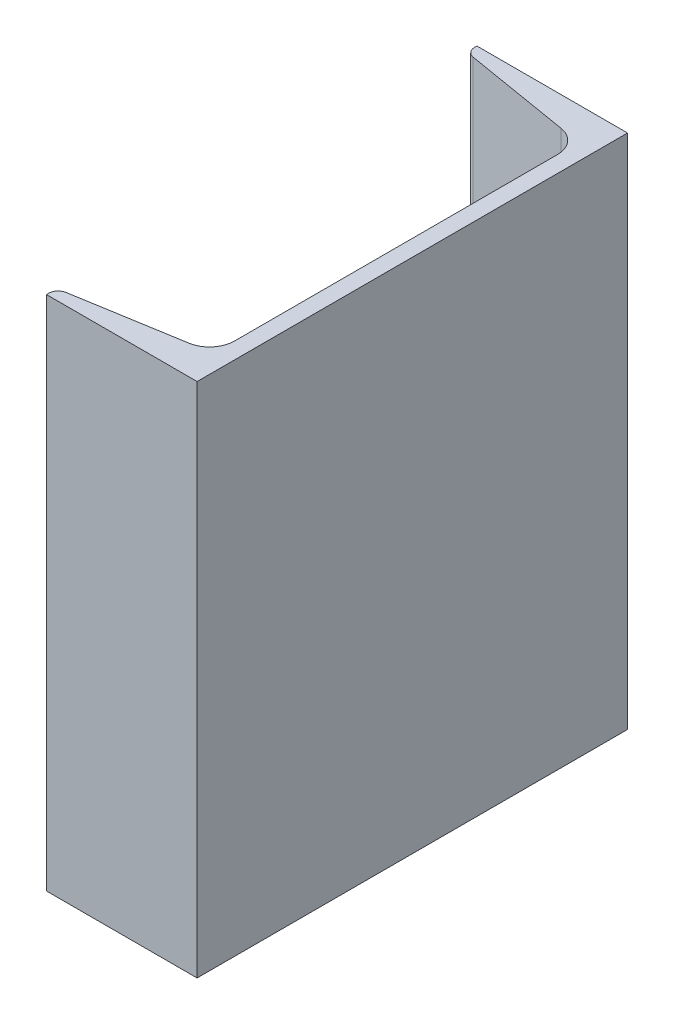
ISO-10303-21;
HEADER;
FILE_DESCRIPTION(('STEP AP214'),'2;1');
FILE_NAME('part.step','',(''),(''),'','','');
FILE_SCHEMA(('AUTOMOTIVE_DESIGN { 1 0 10303 214 1 1 1 1 }'));
ENDSEC;
DATA;
#1=APPLICATION_CONTEXT('core data for automotive mechanical design processes');
#2=APPLICATION_PROTOCOL_DEFINITION('international standard','automotive_design',2000,#1);
#3=PRODUCT_CONTEXT('',#1,'mechanical');
#4=PRODUCT('Part','Part','',(#3));
#5=PRODUCT_RELATED_PRODUCT_CATEGORY('part','',(#4));
#6=PRODUCT_DEFINITION_FORMATION('','',#4);
#7=PRODUCT_DEFINITION_CONTEXT('part definition',#1,'design');
#8=PRODUCT_DEFINITION('design','',#6,#7);
#9=PRODUCT_DEFINITION_SHAPE('','',#8);
#10=(LENGTH_UNIT() NAMED_UNIT(*) SI_UNIT(.MILLI.,.METRE.));
#11=(NAMED_UNIT(*) PLANE_ANGLE_UNIT() SI_UNIT($,.RADIAN.));
#12=(NAMED_UNIT(*) SI_UNIT($,.STERADIAN.) SOLID_ANGLE_UNIT());
#13=UNCERTAINTY_MEASURE_WITH_UNIT(LENGTH_MEASURE(1.E-05),#10,'distance_accuracy_value','');
#14=(GEOMETRIC_REPRESENTATION_CONTEXT(3) GLOBAL_UNCERTAINTY_ASSIGNED_CONTEXT((#13)) GLOBAL_UNIT_ASSIGNED_CONTEXT((#10,
#11,#12)) REPRESENTATION_CONTEXT('',''));
#15=CARTESIAN_POINT('',(0.,0.,0.));
#16=DIRECTION('',(0.,0.,1.));
#17=DIRECTION('',(1.,0.,0.));
#18=AXIS2_PLACEMENT_3D('',#15,#16,#17);
#19=CARTESIAN_POINT('',(0.,152.4,0.));
#20=DIRECTION('',(0.,0.,1.));
#21=DIRECTION('',(1.,0.,0.));
#22=AXIS2_PLACEMENT_3D('',#19,#20,#21);
#23=PLANE('',#22);
#24=DIRECTION('',(-1.,0.,0.));
#25=VECTOR('',#24,1.);
#26=CARTESIAN_POINT('',(0.,0.,0.));
#27=LINE('',#26,#25);
#28=CARTESIAN_POINT('',(0.,0.,0.));
#29=VERTEX_POINT('',#28);
#30=CARTESIAN_POINT('',(-44.45,0.,0.));
#31=VERTEX_POINT('',#30);
#32=EDGE_CURVE('E205',#29,#31,#27,.T.);
#33=ORIENTED_EDGE('',*,*,#32,.T.);
#34=DIRECTION('',(0.,-1.,0.));
#35=VECTOR('',#34,1.);
#36=CARTESIAN_POINT('',(-44.45,152.4,0.));
#37=LINE('',#36,#35);
#38=CARTESIAN_POINT('',(-44.45,152.4,0.));
#39=VERTEX_POINT('',#38);
#40=EDGE_CURVE('E13',#39,#31,#37,.T.);
#41=ORIENTED_EDGE('',*,*,#40,.F.);
#42=DIRECTION('',(-1.,0.,0.));
#43=VECTOR('',#42,1.);
#44=CARTESIAN_POINT('',(0.,152.4,0.));
#45=LINE('',#44,#43);
#46=CARTESIAN_POINT('',(0.,152.4,0.));
#47=VERTEX_POINT('',#46);
#48=EDGE_CURVE('E239',#47,#39,#45,.T.);
#49=ORIENTED_EDGE('',*,*,#48,.F.);
#50=DIRECTION('',(0.,-1.,0.));
#51=VECTOR('',#50,1.);
#52=CARTESIAN_POINT('',(0.,152.4,0.));
#53=LINE('',#52,#51);
#54=EDGE_CURVE('E201',#47,#29,#53,.T.);
#55=ORIENTED_EDGE('',*,*,#54,.T.);
#56=EDGE_LOOP('',(#33,#41,#49,#55));
#57=FACE_BOUND('',#56,.T.);
#58=ADVANCED_FACE('F80',(#57),#23,.F.);
#59=CARTESIAN_POINT('',(-44.45,152.4,0.));
#60=DIRECTION('',(1.,0.,0.));
#61=DIRECTION('',(0.,0.,-1.));
#62=AXIS2_PLACEMENT_3D('',#59,#60,#61);
#63=PLANE('',#62);
#64=DIRECTION('',(0.,0.,1.));
#65=VECTOR('',#64,1.);
#66=CARTESIAN_POINT('',(-44.45,0.,0.));
#67=LINE('',#66,#65);
#68=CARTESIAN_POINT('',(-44.45,0.,0.663810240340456));
#69=VERTEX_POINT('',#68);
#70=EDGE_CURVE('E209',#31,#69,#67,.T.);
#71=ORIENTED_EDGE('',*,*,#70,.T.);
#72=DIRECTION('',(0.,-1.,0.));
#73=VECTOR('',#72,1.);
#74=CARTESIAN_POINT('',(-44.45,152.4,0.663810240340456));
#75=LINE('',#74,#73);
#76=CARTESIAN_POINT('',(-44.45,152.4,0.663810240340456));
#77=VERTEX_POINT('',#76);
#78=EDGE_CURVE('E89',#77,#69,#75,.T.);
#79=ORIENTED_EDGE('',*,*,#78,.F.);
#80=DIRECTION('',(0.,0.,1.));
#81=VECTOR('',#80,1.);
#82=CARTESIAN_POINT('',(-44.45,152.4,0.));
#83=LINE('',#82,#81);
#84=EDGE_CURVE('E152',#39,#77,#83,.T.);
#85=ORIENTED_EDGE('',*,*,#84,.F.);
#86=ORIENTED_EDGE('',*,*,#40,.T.);
#87=EDGE_LOOP('',(#71,#79,#85,#86));
#88=FACE_BOUND('',#87,.T.);
#89=ADVANCED_FACE('F333',(#88),#63,.F.);
#90=CARTESIAN_POINT('',(-41.656,152.4,0.663810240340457));
#91=DIRECTION('',(0.,-1.,0.));
#92=DIRECTION('',(0.,0.,-1.));
#93=AXIS2_PLACEMENT_3D('',#90,#91,#92);
#94=CYLINDRICAL_SURFACE('',#93,2.79400000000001);
#95=CARTESIAN_POINT('',(-41.656,0.,0.663810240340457));
#96=DIRECTION('',(0.,1.,0.));
#97=DIRECTION('',(0.,0.,1.));
#98=AXIS2_PLACEMENT_3D('',#95,#96,#97);
#99=CIRCLE('',#98,2.79400000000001);
#100=CARTESIAN_POINT('',(-42.1153633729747,0.,3.4197894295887));
#101=VERTEX_POINT('',#100);
#102=EDGE_CURVE('E212',#69,#101,#99,.T.);
#103=ORIENTED_EDGE('',*,*,#102,.T.);
#104=DIRECTION('',(0.,-1.,0.));
#105=VECTOR('',#104,1.);
#106=CARTESIAN_POINT('',(-42.1153633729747,152.4,3.4197894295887));
#107=LINE('',#106,#105);
#108=CARTESIAN_POINT('',(-42.1153633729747,152.4,3.4197894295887));
#109=VERTEX_POINT('',#108);
#110=EDGE_CURVE('E266',#109,#101,#107,.T.);
#111=ORIENTED_EDGE('',*,*,#110,.F.);
#112=CARTESIAN_POINT('',(-41.656,152.4,0.663810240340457));
#113=DIRECTION('',(0.,1.,0.));
#114=DIRECTION('',(0.,0.,1.));
#115=AXIS2_PLACEMENT_3D('',#112,#113,#114);
#116=CIRCLE('',#115,2.79400000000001);
#117=EDGE_CURVE('E276',#77,#109,#116,.T.);
#118=ORIENTED_EDGE('',*,*,#117,.F.);
#119=ORIENTED_EDGE('',*,*,#78,.T.);
#120=EDGE_LOOP('',(#103,#111,#118,#119));
#121=FACE_BOUND('',#120,.T.);
#122=ADVANCED_FACE('F274',(#121),#94,.T.);
#123=CARTESIAN_POINT('',(-10.9809511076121,152.4,8.60923668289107));
#124=DIRECTION('',(0.16441065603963,0.,-0.986391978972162));
#125=DIRECTION('',(-0.986391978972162,0.,-0.16441065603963));
#126=AXIS2_PLACEMENT_3D('',#123,#124,#125);
#127=PLANE('',#126);
#128=DIRECTION('',(0.986391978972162,0.,0.16441065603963));
#129=VECTOR('',#128,1.);
#130=CARTESIAN_POINT('',(-10.9809511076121,0.,8.60923668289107));
#131=LINE('',#130,#129);
#132=CARTESIAN_POINT('',(-10.9809511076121,0.,8.60923668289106));
#133=VERTEX_POINT('',#132);
#134=EDGE_CURVE('E215',#101,#133,#131,.T.);
#135=ORIENTED_EDGE('',*,*,#134,.T.);
#136=DIRECTION('',(0.,-1.,0.));
#137=VECTOR('',#136,1.);
#138=CARTESIAN_POINT('',(-10.9809511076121,152.4,8.60923668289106));
#139=LINE('',#138,#137);
#140=CARTESIAN_POINT('',(-10.9809511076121,152.4,8.60923668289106));
#141=VERTEX_POINT('',#140);
#142=EDGE_CURVE('E262',#141,#133,#139,.T.);
#143=ORIENTED_EDGE('',*,*,#142,.F.);
#144=DIRECTION('',(0.986391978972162,0.,0.16441065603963));
#145=VECTOR('',#144,1.);
#146=CARTESIAN_POINT('',(-10.9809511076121,152.4,8.60923668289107));
#147=LINE('',#146,#145);
#148=EDGE_CURVE('E295',#109,#141,#147,.T.);
#149=ORIENTED_EDGE('',*,*,#148,.F.);
#150=ORIENTED_EDGE('',*,*,#110,.T.);
#151=EDGE_LOOP('',(#135,#143,#149,#150));
#152=FACE_BOUND('',#151,.T.);
#153=ADVANCED_FACE('F285',(#152),#127,.F.);
#154=CARTESIAN_POINT('',(-12.192,152.4,15.875));
#155=DIRECTION('',(0.,-1.,0.));
#156=DIRECTION('',(0.,0.,-1.));
#157=AXIS2_PLACEMENT_3D('',#154,#155,#156);
#158=CYLINDRICAL_SURFACE('',#157,7.36599999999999);
#159=CARTESIAN_POINT('',(-12.192,0.,15.875));
#160=DIRECTION('',(0.,-1.,0.));
#161=DIRECTION('',(0.,0.,1.));
#162=AXIS2_PLACEMENT_3D('',#159,#160,#161);
#163=CIRCLE('',#162,7.36599999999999);
#164=CARTESIAN_POINT('',(-4.826,0.,15.875));
#165=VERTEX_POINT('',#164);
#166=EDGE_CURVE('E218',#133,#165,#163,.T.);
#167=ORIENTED_EDGE('',*,*,#166,.T.);
#168=DIRECTION('',(0.,-1.,0.));
#169=VECTOR('',#168,1.);
#170=CARTESIAN_POINT('',(-4.826,152.4,15.875));
#171=LINE('',#170,#169);
#172=CARTESIAN_POINT('',(-4.826,152.4,15.875));
#173=VERTEX_POINT('',#172);
#174=EDGE_CURVE('E258',#173,#165,#171,.T.);
#175=ORIENTED_EDGE('',*,*,#174,.F.);
#176=CARTESIAN_POINT('',(-12.192,152.4,15.875));
#177=DIRECTION('',(0.,-1.,0.));
#178=DIRECTION('',(0.,0.,1.));
#179=AXIS2_PLACEMENT_3D('',#176,#177,#178);
#180=CIRCLE('',#179,7.36599999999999);
#181=EDGE_CURVE('E291',#141,#173,#180,.T.);
#182=ORIENTED_EDGE('',*,*,#181,.F.);
#183=ORIENTED_EDGE('',*,*,#142,.T.);
#184=EDGE_LOOP('',(#167,#175,#182,#183));
#185=FACE_BOUND('',#184,.T.);
#186=ADVANCED_FACE('F289',(#185),#158,.F.);
#187=CARTESIAN_POINT('',(-4.826,152.4,111.125));
#188=DIRECTION('',(1.,0.,0.));
#189=DIRECTION('',(0.,0.,-1.));
#190=AXIS2_PLACEMENT_3D('',#187,#188,#189);
#191=PLANE('',#190);
#192=DIRECTION('',(0.,0.,1.));
#193=VECTOR('',#192,1.);
#194=CARTESIAN_POINT('',(-4.826,0.,111.125));
#195=LINE('',#194,#193);
#196=CARTESIAN_POINT('',(-4.82600000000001,0.,111.125));
#197=VERTEX_POINT('',#196);
#198=EDGE_CURVE('E221',#165,#197,#195,.T.);
#199=ORIENTED_EDGE('',*,*,#198,.T.);
#200=DIRECTION('',(0.,-1.,0.));
#201=VECTOR('',#200,1.);
#202=CARTESIAN_POINT('',(-4.82600000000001,152.4,111.125));
#203=LINE('',#202,#201);
#204=CARTESIAN_POINT('',(-4.82600000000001,152.4,111.125));
#205=VERTEX_POINT('',#204);
#206=EDGE_CURVE('E254',#205,#197,#203,.T.);
#207=ORIENTED_EDGE('',*,*,#206,.F.);
#208=DIRECTION('',(0.,0.,1.));
#209=VECTOR('',#208,1.);
#210=CARTESIAN_POINT('',(-4.826,152.4,111.125));
#211=LINE('',#210,#209);
#212=EDGE_CURVE('E294',#173,#205,#211,.T.);
#213=ORIENTED_EDGE('',*,*,#212,.F.);
#214=ORIENTED_EDGE('',*,*,#174,.T.);
#215=EDGE_LOOP('',(#199,#207,#213,#214));
#216=FACE_BOUND('',#215,.T.);
#217=ADVANCED_FACE('F346',(#216),#191,.F.);
#218=CARTESIAN_POINT('',(-12.192,152.4,111.125));
#219=DIRECTION('',(0.,-1.,0.));
#220=DIRECTION('',(0.,0.,-1.));
#221=AXIS2_PLACEMENT_3D('',#218,#219,#220);
#222=CYLINDRICAL_SURFACE('',#221,7.36599999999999);
#223=CARTESIAN_POINT('',(-12.192,0.,111.125));
#224=DIRECTION('',(0.,-1.,0.));
#225=DIRECTION('',(0.,0.,-1.));
#226=AXIS2_PLACEMENT_3D('',#223,#224,#225);
#227=CIRCLE('',#226,7.36599999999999);
#228=CARTESIAN_POINT('',(-10.9809511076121,0.,118.390763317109));
#229=VERTEX_POINT('',#228);
#230=EDGE_CURVE('E224',#197,#229,#227,.T.);
#231=ORIENTED_EDGE('',*,*,#230,.T.);
#232=DIRECTION('',(0.,-1.,0.));
#233=VECTOR('',#232,1.);
#234=CARTESIAN_POINT('',(-10.9809511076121,152.4,118.390763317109));
#235=LINE('',#234,#233);
#236=CARTESIAN_POINT('',(-10.9809511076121,152.4,118.390763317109));
#237=VERTEX_POINT('',#236);
#238=EDGE_CURVE('E250',#237,#229,#235,.T.);
#239=ORIENTED_EDGE('',*,*,#238,.F.);
#240=CARTESIAN_POINT('',(-12.192,152.4,111.125));
#241=DIRECTION('',(0.,-1.,0.));
#242=DIRECTION('',(0.,0.,-1.));
#243=AXIS2_PLACEMENT_3D('',#240,#241,#242);
#244=CIRCLE('',#243,7.36599999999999);
#245=EDGE_CURVE('E299',#205,#237,#244,.T.);
#246=ORIENTED_EDGE('',*,*,#245,.F.);
#247=ORIENTED_EDGE('',*,*,#206,.T.);
#248=EDGE_LOOP('',(#231,#239,#246,#247));
#249=FACE_BOUND('',#248,.T.);
#250=ADVANCED_FACE('F349',(#249),#222,.F.);
#251=CARTESIAN_POINT('',(-10.9809511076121,152.4,118.390763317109));
#252=DIRECTION('',(0.16441065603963,0.,0.986391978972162));
#253=DIRECTION('',(0.986391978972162,0.,-0.16441065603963));
#254=AXIS2_PLACEMENT_3D('',#251,#252,#253);
#255=PLANE('',#254);
#256=DIRECTION('',(-0.986391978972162,0.,0.16441065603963));
#257=VECTOR('',#256,1.);
#258=CARTESIAN_POINT('',(-10.9809511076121,0.,118.390763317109));
#259=LINE('',#258,#257);
#260=CARTESIAN_POINT('',(-42.1153633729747,0.,123.580210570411));
#261=VERTEX_POINT('',#260);
#262=EDGE_CURVE('E227',#229,#261,#259,.T.);
#263=ORIENTED_EDGE('',*,*,#262,.T.);
#264=DIRECTION('',(0.,-1.,0.));
#265=VECTOR('',#264,1.);
#266=CARTESIAN_POINT('',(-42.1153633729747,152.4,123.580210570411));
#267=LINE('',#266,#265);
#268=CARTESIAN_POINT('',(-42.1153633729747,152.4,123.580210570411));
#269=VERTEX_POINT('',#268);
#270=EDGE_CURVE('E246',#269,#261,#267,.T.);
#271=ORIENTED_EDGE('',*,*,#270,.F.);
#272=DIRECTION('',(-0.986391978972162,0.,0.16441065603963));
#273=VECTOR('',#272,1.);
#274=CARTESIAN_POINT('',(-10.9809511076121,152.4,118.390763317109));
#275=LINE('',#274,#273);
#276=EDGE_CURVE('E306',#237,#269,#275,.T.);
#277=ORIENTED_EDGE('',*,*,#276,.F.);
#278=ORIENTED_EDGE('',*,*,#238,.T.);
#279=EDGE_LOOP('',(#263,#271,#277,#278));
#280=FACE_BOUND('',#279,.T.);
#281=ADVANCED_FACE('F314',(#280),#255,.F.);
#282=CARTESIAN_POINT('',(-41.656,152.4,126.33618975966));
#283=DIRECTION('',(0.,-1.,0.));
#284=DIRECTION('',(0.,0.,-1.));
#285=AXIS2_PLACEMENT_3D('',#282,#283,#284);
#286=CYLINDRICAL_SURFACE('',#285,2.79400000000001);
#287=CARTESIAN_POINT('',(-41.656,0.,126.33618975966));
#288=DIRECTION('',(0.,1.,0.));
#289=DIRECTION('',(0.,0.,-1.));
#290=AXIS2_PLACEMENT_3D('',#287,#288,#289);
#291=CIRCLE('',#290,2.79400000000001);
#292=CARTESIAN_POINT('',(-44.45,0.,126.33618975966));
#293=VERTEX_POINT('',#292);
#294=EDGE_CURVE('E230',#261,#293,#291,.T.);
#295=ORIENTED_EDGE('',*,*,#294,.T.);
#296=DIRECTION('',(0.,-1.,0.));
#297=VECTOR('',#296,1.);
#298=CARTESIAN_POINT('',(-44.45,152.4,126.33618975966));
#299=LINE('',#298,#297);
#300=CARTESIAN_POINT('',(-44.45,152.4,126.33618975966));
#301=VERTEX_POINT('',#300);
#302=EDGE_CURVE('E194',#301,#293,#299,.T.);
#303=ORIENTED_EDGE('',*,*,#302,.F.);
#304=CARTESIAN_POINT('',(-41.656,152.4,126.33618975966));
#305=DIRECTION('',(0.,1.,0.));
#306=DIRECTION('',(0.,0.,-1.));
#307=AXIS2_PLACEMENT_3D('',#304,#305,#306);
#308=CIRCLE('',#307,2.79400000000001);
#309=EDGE_CURVE('E183',#269,#301,#308,.T.);
#310=ORIENTED_EDGE('',*,*,#309,.F.);
#311=ORIENTED_EDGE('',*,*,#270,.T.);
#312=EDGE_LOOP('',(#295,#303,#310,#311));
#313=FACE_BOUND('',#312,.T.);
#314=ADVANCED_FACE('F318',(#313),#286,.T.);
#315=CARTESIAN_POINT('',(-44.45,152.4,127.));
#316=DIRECTION('',(1.,0.,0.));
#317=DIRECTION('',(0.,0.,-1.));
#318=AXIS2_PLACEMENT_3D('',#315,#316,#317);
#319=PLANE('',#318);
#320=DIRECTION('',(0.,0.,1.));
#321=VECTOR('',#320,1.);
#322=CARTESIAN_POINT('',(-44.45,0.,127.));
#323=LINE('',#322,#321);
#324=CARTESIAN_POINT('',(-44.45,0.,127.));
#325=VERTEX_POINT('',#324);
#326=EDGE_CURVE('E192',#293,#325,#323,.T.);
#327=ORIENTED_EDGE('',*,*,#326,.T.);
#328=DIRECTION('',(0.,-1.,0.));
#329=VECTOR('',#328,1.);
#330=CARTESIAN_POINT('',(-44.45,152.4,127.));
#331=LINE('',#330,#329);
#332=CARTESIAN_POINT('',(-44.45,152.4,127.));
#333=VERTEX_POINT('',#332);
#334=EDGE_CURVE('E189',#333,#325,#331,.T.);
#335=ORIENTED_EDGE('',*,*,#334,.F.);
#336=DIRECTION('',(0.,0.,1.));
#337=VECTOR('',#336,1.);
#338=CARTESIAN_POINT('',(-44.45,152.4,127.));
#339=LINE('',#338,#337);
#340=EDGE_CURVE('E177',#301,#333,#339,.T.);
#341=ORIENTED_EDGE('',*,*,#340,.F.);
#342=ORIENTED_EDGE('',*,*,#302,.T.);
#343=EDGE_LOOP('',(#327,#335,#341,#342));
#344=FACE_BOUND('',#343,.T.);
#345=ADVANCED_FACE('F190',(#344),#319,.F.);
#346=CARTESIAN_POINT('',(0.,152.4,127.));
#347=DIRECTION('',(0.,0.,-1.));
#348=DIRECTION('',(-1.,0.,0.));
#349=AXIS2_PLACEMENT_3D('',#346,#347,#348);
#350=PLANE('',#349);
#351=DIRECTION('',(1.,0.,0.));
#352=VECTOR('',#351,1.);
#353=CARTESIAN_POINT('',(0.,0.,127.));
#354=LINE('',#353,#352);
#355=CARTESIAN_POINT('',(0.,0.,127.));
#356=VERTEX_POINT('',#355);
#357=EDGE_CURVE('E138',#325,#356,#354,.T.);
#358=ORIENTED_EDGE('',*,*,#357,.T.);
#359=DIRECTION('',(0.,-1.,0.));
#360=VECTOR('',#359,1.);
#361=CARTESIAN_POINT('',(0.,152.4,127.));
#362=LINE('',#361,#360);
#363=CARTESIAN_POINT('',(0.,152.4,127.));
#364=VERTEX_POINT('',#363);
#365=EDGE_CURVE('E195',#364,#356,#362,.T.);
#366=ORIENTED_EDGE('',*,*,#365,.F.);
#367=DIRECTION('',(1.,0.,0.));
#368=VECTOR('',#367,1.);
#369=CARTESIAN_POINT('',(0.,152.4,127.));
#370=LINE('',#369,#368);
#371=EDGE_CURVE('E181',#333,#364,#370,.T.);
#372=ORIENTED_EDGE('',*,*,#371,.F.);
#373=ORIENTED_EDGE('',*,*,#334,.T.);
#374=EDGE_LOOP('',(#358,#366,#372,#373));
#375=FACE_BOUND('',#374,.T.);
#376=ADVANCED_FACE('F197',(#375),#350,.F.);
#377=CARTESIAN_POINT('',(0.,152.4,0.));
#378=DIRECTION('',(-1.,0.,0.));
#379=DIRECTION('',(0.,0.,1.));
#380=AXIS2_PLACEMENT_3D('',#377,#378,#379);
#381=PLANE('',#380);
#382=DIRECTION('',(0.,0.,-1.));
#383=VECTOR('',#382,1.);
#384=CARTESIAN_POINT('',(0.,0.,0.));
#385=LINE('',#384,#383);
#386=EDGE_CURVE('E144',#356,#29,#385,.T.);
#387=ORIENTED_EDGE('',*,*,#386,.T.);
#388=ORIENTED_EDGE('',*,*,#54,.F.);
#389=DIRECTION('',(0.,0.,-1.));
#390=VECTOR('',#389,1.);
#391=CARTESIAN_POINT('',(0.,152.4,0.));
#392=LINE('',#391,#390);
#393=EDGE_CURVE('E97',#364,#47,#392,.T.);
#394=ORIENTED_EDGE('',*,*,#393,.F.);
#395=ORIENTED_EDGE('',*,*,#365,.T.);
#396=EDGE_LOOP('',(#387,#388,#394,#395));
#397=FACE_BOUND('',#396,.T.);
#398=ADVANCED_FACE('F322',(#397),#381,.F.);
#399=CARTESIAN_POINT('',(-41.656,152.4,0.663810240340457));
#400=DIRECTION('',(0.,1.,0.));
#401=DIRECTION('',(0.,0.,1.));
#402=AXIS2_PLACEMENT_3D('',#399,#400,#401);
#403=PLANE('',#402);
#404=ORIENTED_EDGE('',*,*,#48,.T.);
#405=ORIENTED_EDGE('',*,*,#84,.T.);
#406=ORIENTED_EDGE('',*,*,#117,.T.);
#407=ORIENTED_EDGE('',*,*,#148,.T.);
#408=ORIENTED_EDGE('',*,*,#181,.T.);
#409=ORIENTED_EDGE('',*,*,#212,.T.);
#410=ORIENTED_EDGE('',*,*,#245,.T.);
#411=ORIENTED_EDGE('',*,*,#276,.T.);
#412=ORIENTED_EDGE('',*,*,#309,.T.);
#413=ORIENTED_EDGE('',*,*,#340,.T.);
#414=ORIENTED_EDGE('',*,*,#371,.T.);
#415=ORIENTED_EDGE('',*,*,#393,.T.);
#416=EDGE_LOOP('',(#404,#405,#406,#407,#408,#409,#410,#411,#412,#413,#414,#415));
#417=FACE_BOUND('',#416,.T.);
#418=ADVANCED_FACE('F179',(#417),#403,.T.);
#419=CARTESIAN_POINT('',(-41.656,0.,0.663810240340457));
#420=DIRECTION('',(0.,1.,0.));
#421=DIRECTION('',(0.,0.,1.));
#422=AXIS2_PLACEMENT_3D('',#419,#420,#421);
#423=PLANE('',#422);
#424=ORIENTED_EDGE('',*,*,#32,.F.);
#425=ORIENTED_EDGE('',*,*,#386,.F.);
#426=ORIENTED_EDGE('',*,*,#357,.F.);
#427=ORIENTED_EDGE('',*,*,#326,.F.);
#428=ORIENTED_EDGE('',*,*,#294,.F.);
#429=ORIENTED_EDGE('',*,*,#262,.F.);
#430=ORIENTED_EDGE('',*,*,#230,.F.);
#431=ORIENTED_EDGE('',*,*,#198,.F.);
#432=ORIENTED_EDGE('',*,*,#166,.F.);
#433=ORIENTED_EDGE('',*,*,#134,.F.);
#434=ORIENTED_EDGE('',*,*,#102,.F.);
#435=ORIENTED_EDGE('',*,*,#70,.F.);
#436=EDGE_LOOP('',(#424,#425,#426,#427,#428,#429,#430,#431,#432,#433,#434,#435));
#437=FACE_BOUND('',#436,.T.);
#438=ADVANCED_FACE('F280',(#437),#423,.F.);
#439=CLOSED_SHELL('',(#58,#89,#122,#153,#186,#217,#250,#281,#314,#345,#376,#398,#418,#438));
#440=MANIFOLD_SOLID_BREP('B2',#439);
#441=ADVANCED_BREP_SHAPE_REPRESENTATION('',(#18,#440),#14);
#442=SHAPE_DEFINITION_REPRESENTATION(#9,#441);
ENDSEC;
END-ISO-10303-21;
